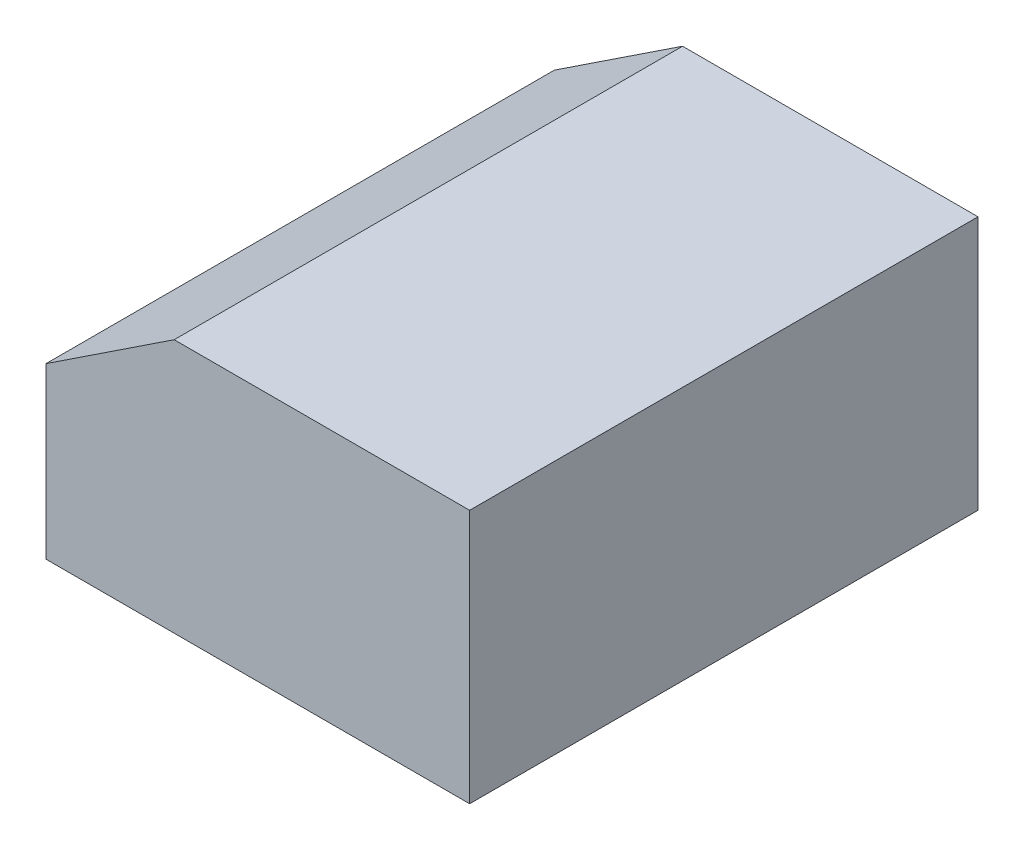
ISO-10303-21;
HEADER;
FILE_DESCRIPTION(('STEP AP214'),'2;1');
FILE_NAME('part.step','',(''),(''),'','','');
FILE_SCHEMA(('AUTOMOTIVE_DESIGN { 1 0 10303 214 1 1 1 1 }'));
ENDSEC;
DATA;
#1=APPLICATION_CONTEXT('core data for automotive mechanical design processes');
#2=APPLICATION_PROTOCOL_DEFINITION('international standard','automotive_design',2000,#1);
#3=PRODUCT_CONTEXT('',#1,'mechanical');
#4=PRODUCT('Part','Part','',(#3));
#5=PRODUCT_RELATED_PRODUCT_CATEGORY('part','',(#4));
#6=PRODUCT_DEFINITION_FORMATION('','',#4);
#7=PRODUCT_DEFINITION_CONTEXT('part definition',#1,'design');
#8=PRODUCT_DEFINITION('design','',#6,#7);
#9=PRODUCT_DEFINITION_SHAPE('','',#8);
#10=(LENGTH_UNIT() NAMED_UNIT(*) SI_UNIT(.MILLI.,.METRE.));
#11=(NAMED_UNIT(*) PLANE_ANGLE_UNIT() SI_UNIT($,.RADIAN.));
#12=(NAMED_UNIT(*) SI_UNIT($,.STERADIAN.) SOLID_ANGLE_UNIT());
#13=UNCERTAINTY_MEASURE_WITH_UNIT(LENGTH_MEASURE(1.E-05),#10,'distance_accuracy_value','');
#14=(GEOMETRIC_REPRESENTATION_CONTEXT(3) GLOBAL_UNCERTAINTY_ASSIGNED_CONTEXT((#13)) GLOBAL_UNIT_ASSIGNED_CONTEXT((#10,
#11,#12)) REPRESENTATION_CONTEXT('',''));
#15=CARTESIAN_POINT('',(0.,0.,0.));
#16=DIRECTION('',(0.,0.,1.));
#17=DIRECTION('',(1.,0.,0.));
#18=AXIS2_PLACEMENT_3D('',#15,#16,#17);
#19=CARTESIAN_POINT('',(0.,3.42187948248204,30.));
#20=DIRECTION('',(1.,0.,0.));
#21=DIRECTION('',(0.,1.,0.));
#22=AXIS2_PLACEMENT_3D('',#19,#20,#21);
#23=PLANE('',#22);
#24=DIRECTION('',(0.,-1.,0.));
#25=VECTOR('',#24,1.);
#26=CARTESIAN_POINT('',(0.,3.42187948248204,0.));
#27=LINE('',#26,#25);
#28=CARTESIAN_POINT('',(0.,13.4171881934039,0.));
#29=VERTEX_POINT('',#28);
#30=CARTESIAN_POINT('',(0.,3.42187948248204,0.));
#31=VERTEX_POINT('',#30);
#32=EDGE_CURVE('E76',#29,#31,#27,.T.);
#33=ORIENTED_EDGE('',*,*,#32,.T.);
#34=DIRECTION('',(0.,0.,-1.));
#35=VECTOR('',#34,1.);
#36=CARTESIAN_POINT('',(0.,3.42187948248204,30.));
#37=LINE('',#36,#35);
#38=CARTESIAN_POINT('',(0.,3.42187948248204,30.));
#39=VERTEX_POINT('',#38);
#40=EDGE_CURVE('E11',#39,#31,#37,.T.);
#41=ORIENTED_EDGE('',*,*,#40,.F.);
#42=DIRECTION('',(0.,-1.,0.));
#43=VECTOR('',#42,1.);
#44=CARTESIAN_POINT('',(0.,3.42187948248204,30.));
#45=LINE('',#44,#43);
#46=CARTESIAN_POINT('',(0.,13.4171881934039,30.));
#47=VERTEX_POINT('',#46);
#48=EDGE_CURVE('E97',#47,#39,#45,.T.);
#49=ORIENTED_EDGE('',*,*,#48,.F.);
#50=DIRECTION('',(0.,0.,-1.));
#51=VECTOR('',#50,1.);
#52=CARTESIAN_POINT('',(0.,13.4171881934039,30.));
#53=LINE('',#52,#51);
#54=EDGE_CURVE('E89',#47,#29,#53,.T.);
#55=ORIENTED_EDGE('',*,*,#54,.T.);
#56=EDGE_LOOP('',(#33,#41,#49,#55));
#57=FACE_BOUND('',#56,.T.);
#58=ADVANCED_FACE('F26',(#57),#23,.F.);
#59=CARTESIAN_POINT('',(0.,3.42187948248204,30.));
#60=DIRECTION('',(0.,1.,0.));
#61=DIRECTION('',(-1.,0.,0.));
#62=AXIS2_PLACEMENT_3D('',#59,#60,#61);
#63=PLANE('',#62);
#64=DIRECTION('',(1.,0.,0.));
#65=VECTOR('',#64,1.);
#66=CARTESIAN_POINT('',(0.,3.42187948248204,0.));
#67=LINE('',#66,#65);
#68=CARTESIAN_POINT('',(25.,3.42187948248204,0.));
#69=VERTEX_POINT('',#68);
#70=EDGE_CURVE('E72',#31,#69,#67,.T.);
#71=ORIENTED_EDGE('',*,*,#70,.T.);
#72=DIRECTION('',(0.,0.,-1.));
#73=VECTOR('',#72,1.);
#74=CARTESIAN_POINT('',(25.,3.42187948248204,30.));
#75=LINE('',#74,#73);
#76=CARTESIAN_POINT('',(25.,3.42187948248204,30.));
#77=VERTEX_POINT('',#76);
#78=EDGE_CURVE('E33',#77,#69,#75,.T.);
#79=ORIENTED_EDGE('',*,*,#78,.F.);
#80=DIRECTION('',(1.,0.,0.));
#81=VECTOR('',#80,1.);
#82=CARTESIAN_POINT('',(0.,3.42187948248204,30.));
#83=LINE('',#82,#81);
#84=EDGE_CURVE('E85',#39,#77,#83,.T.);
#85=ORIENTED_EDGE('',*,*,#84,.F.);
#86=ORIENTED_EDGE('',*,*,#40,.T.);
#87=EDGE_LOOP('',(#71,#79,#85,#86));
#88=FACE_BOUND('',#87,.T.);
#89=ADVANCED_FACE('F84',(#88),#63,.F.);
#90=CARTESIAN_POINT('',(25.,3.42187948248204,30.));
#91=DIRECTION('',(-1.,0.,0.));
#92=DIRECTION('',(0.,0.,1.));
#93=AXIS2_PLACEMENT_3D('',#90,#91,#92);
#94=PLANE('',#93);
#95=DIRECTION('',(0.,1.,0.));
#96=VECTOR('',#95,1.);
#97=CARTESIAN_POINT('',(25.,3.42187948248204,0.));
#98=LINE('',#97,#96);
#99=CARTESIAN_POINT('',(25.,18.421879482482,0.));
#100=VERTEX_POINT('',#99);
#101=EDGE_CURVE('E78',#69,#100,#98,.T.);
#102=ORIENTED_EDGE('',*,*,#101,.T.);
#103=DIRECTION('',(0.,0.,-1.));
#104=VECTOR('',#103,1.);
#105=CARTESIAN_POINT('',(25.,18.421879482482,30.));
#106=LINE('',#105,#104);
#107=CARTESIAN_POINT('',(25.,18.421879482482,30.));
#108=VERTEX_POINT('',#107);
#109=EDGE_CURVE('E108',#108,#100,#106,.T.);
#110=ORIENTED_EDGE('',*,*,#109,.F.);
#111=DIRECTION('',(0.,1.,0.));
#112=VECTOR('',#111,1.);
#113=CARTESIAN_POINT('',(25.,3.42187948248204,30.));
#114=LINE('',#113,#112);
#115=EDGE_CURVE('E100',#77,#108,#114,.T.);
#116=ORIENTED_EDGE('',*,*,#115,.F.);
#117=ORIENTED_EDGE('',*,*,#78,.T.);
#118=EDGE_LOOP('',(#102,#110,#116,#117));
#119=FACE_BOUND('',#118,.T.);
#120=ADVANCED_FACE('F112',(#119),#94,.F.);
#121=CARTESIAN_POINT('',(25.,18.421879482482,30.));
#122=DIRECTION('',(0.,-1.,0.));
#123=DIRECTION('',(0.,0.,-1.));
#124=AXIS2_PLACEMENT_3D('',#121,#122,#123);
#125=PLANE('',#124);
#126=DIRECTION('',(-1.,0.,0.));
#127=VECTOR('',#126,1.);
#128=CARTESIAN_POINT('',(25.,18.421879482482,0.));
#129=LINE('',#128,#127);
#130=CARTESIAN_POINT('',(7.56523101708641,18.421879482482,0.));
#131=VERTEX_POINT('',#130);
#132=EDGE_CURVE('E93',#100,#131,#129,.T.);
#133=ORIENTED_EDGE('',*,*,#132,.T.);
#134=DIRECTION('',(0.,0.,-1.));
#135=VECTOR('',#134,1.);
#136=CARTESIAN_POINT('',(7.56523101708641,18.421879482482,30.));
#137=LINE('',#136,#135);
#138=CARTESIAN_POINT('',(7.56523101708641,18.421879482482,30.));
#139=VERTEX_POINT('',#138);
#140=EDGE_CURVE('E105',#139,#131,#137,.T.);
#141=ORIENTED_EDGE('',*,*,#140,.F.);
#142=DIRECTION('',(-1.,0.,0.));
#143=VECTOR('',#142,1.);
#144=CARTESIAN_POINT('',(25.,18.421879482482,30.));
#145=LINE('',#144,#143);
#146=EDGE_CURVE('E45',#108,#139,#145,.T.);
#147=ORIENTED_EDGE('',*,*,#146,.F.);
#148=ORIENTED_EDGE('',*,*,#109,.T.);
#149=EDGE_LOOP('',(#133,#141,#147,#148));
#150=FACE_BOUND('',#149,.T.);
#151=ADVANCED_FACE('F123',(#150),#125,.F.);
#152=CARTESIAN_POINT('',(0.,13.4171881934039,30.));
#153=DIRECTION('',(0.551735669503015,-0.834019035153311,0.));
#154=DIRECTION('',(0.834019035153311,0.551735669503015,0.));
#155=AXIS2_PLACEMENT_3D('',#152,#153,#154);
#156=PLANE('',#155);
#157=DIRECTION('',(-0.834019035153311,-0.551735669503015,0.));
#158=VECTOR('',#157,1.);
#159=CARTESIAN_POINT('',(0.,13.4171881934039,0.));
#160=LINE('',#159,#158);
#161=EDGE_CURVE('E95',#131,#29,#160,.T.);
#162=ORIENTED_EDGE('',*,*,#161,.T.);
#163=ORIENTED_EDGE('',*,*,#54,.F.);
#164=DIRECTION('',(-0.834019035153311,-0.551735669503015,0.));
#165=VECTOR('',#164,1.);
#166=CARTESIAN_POINT('',(0.,13.4171881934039,30.));
#167=LINE('',#166,#165);
#168=EDGE_CURVE('E40',#139,#47,#167,.T.);
#169=ORIENTED_EDGE('',*,*,#168,.F.);
#170=ORIENTED_EDGE('',*,*,#140,.T.);
#171=EDGE_LOOP('',(#162,#163,#169,#170));
#172=FACE_BOUND('',#171,.T.);
#173=ADVANCED_FACE('F116',(#172),#156,.F.);
#174=CARTESIAN_POINT('',(0.,18.421879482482,30.));
#175=DIRECTION('',(0.,0.,1.));
#176=DIRECTION('',(1.,0.,0.));
#177=AXIS2_PLACEMENT_3D('',#174,#175,#176);
#178=PLANE('',#177);
#179=ORIENTED_EDGE('',*,*,#48,.T.);
#180=ORIENTED_EDGE('',*,*,#84,.T.);
#181=ORIENTED_EDGE('',*,*,#115,.T.);
#182=ORIENTED_EDGE('',*,*,#146,.T.);
#183=ORIENTED_EDGE('',*,*,#168,.T.);
#184=EDGE_LOOP('',(#179,#180,#181,#182,#183));
#185=FACE_BOUND('',#184,.T.);
#186=ADVANCED_FACE('F114',(#185),#178,.T.);
#187=CARTESIAN_POINT('',(0.,18.421879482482,0.));
#188=DIRECTION('',(0.,0.,1.));
#189=DIRECTION('',(1.,0.,0.));
#190=AXIS2_PLACEMENT_3D('',#187,#188,#189);
#191=PLANE('',#190);
#192=ORIENTED_EDGE('',*,*,#32,.F.);
#193=ORIENTED_EDGE('',*,*,#161,.F.);
#194=ORIENTED_EDGE('',*,*,#132,.F.);
#195=ORIENTED_EDGE('',*,*,#101,.F.);
#196=ORIENTED_EDGE('',*,*,#70,.F.);
#197=EDGE_LOOP('',(#192,#193,#194,#195,#196));
#198=FACE_BOUND('',#197,.T.);
#199=ADVANCED_FACE('F73',(#198),#191,.F.);
#200=CLOSED_SHELL('',(#58,#89,#120,#151,#173,#186,#199));
#201=MANIFOLD_SOLID_BREP('B2',#200);
#202=ADVANCED_BREP_SHAPE_REPRESENTATION('',(#18,#201),#14);
#203=SHAPE_DEFINITION_REPRESENTATION(#9,#202);
ENDSEC;
END-ISO-10303-21;
